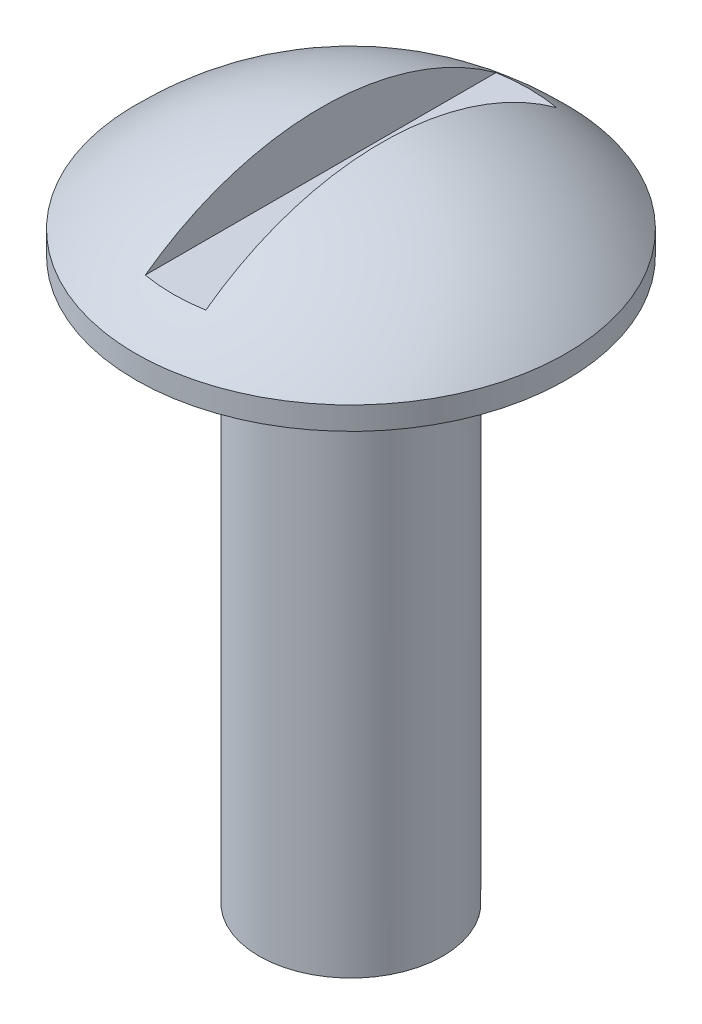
from build123d import *

# Parameters (mm, degrees)
SKETCH1_R           = 4.8768
BASE_EXTRUDE_DEPTH  = 0.51816
DOME1_FACE_RADIUS   = 4.8768
DOME1_HEIGHT        = 2.07264
SKETCH3_R           = 2.0828
BOSS_EXTRUDE1_DEPTH = 12.7
CUT_EXTRUDE1_DEPTH  = 15.451863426


with BuildPart() as part:
    # Sketch1 → Base-Extrude (new body)
    with BuildSketch(Plane(origin=(0, 0, 0), x_dir=(1, 0, 0), z_dir=(0, 1, 0))):
        with Locations(Location((0, 0, 0), (0, 0, 270))):
            Circle(SKETCH1_R)
    extrude(amount=BASE_EXTRUDE_DEPTH)

    # Dome1: a dome of height H over a round flat face of radius A is a cap of a sphere of radius (A * A + H * H) / (2 * H)
    dome1_r = (DOME1_FACE_RADIUS * DOME1_FACE_RADIUS + DOME1_HEIGHT * DOME1_HEIGHT) / (2 * DOME1_HEIGHT)
    dome1_base = Plane((0, 0.51816, 0), z_dir=(0, 1, 0))
    with Locations(dome1_base.offset(DOME1_HEIGHT - dome1_r)):
        dome1_ball = Sphere(dome1_r, mode=Mode.PRIVATE)
    add(split(dome1_ball, bisect_by=dome1_base, keep=Keep.TOP, mode=Mode.PRIVATE))

    # Sketch3 → Boss-Extrude1 (add)
    with BuildSketch(Plane.XZ):
        with Locations(Location((0, 0, 0), (0, 0, 90))):
            Circle(SKETCH3_R)
    extrude(amount=BOSS_EXTRUDE1_DEPTH)

    # Sketch4 → Cut-Extrude1 (cut, through all)
    with BuildSketch(Plane.XY):
        with BuildLine():
            Line((-0.6858, 2.555993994), (-0.6858, 1.260593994))
            Line((-0.6858, 1.260593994), (0.6858, 1.260593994))
            Line((0.6858, 1.260593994), (0.6858, 2.555993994))
            ThreePointArc((0.6858, 2.555993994), (0, 2.5908), (-0.6858, 2.555993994))
        make_face()
    cut_extrude1 = extrude(amount=-CUT_EXTRUDE1_DEPTH, mode=Mode.SUBTRACT)

    # Mirror1: Cut-Extrude1 across plane
    add(cut_extrude1.mirror(Plane(origin=(0, -4.182931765, 0), x_dir=(1, 0, 0), z_dir=(0, 0, 1))), mode=Mode.SUBTRACT)


solid = part.part
